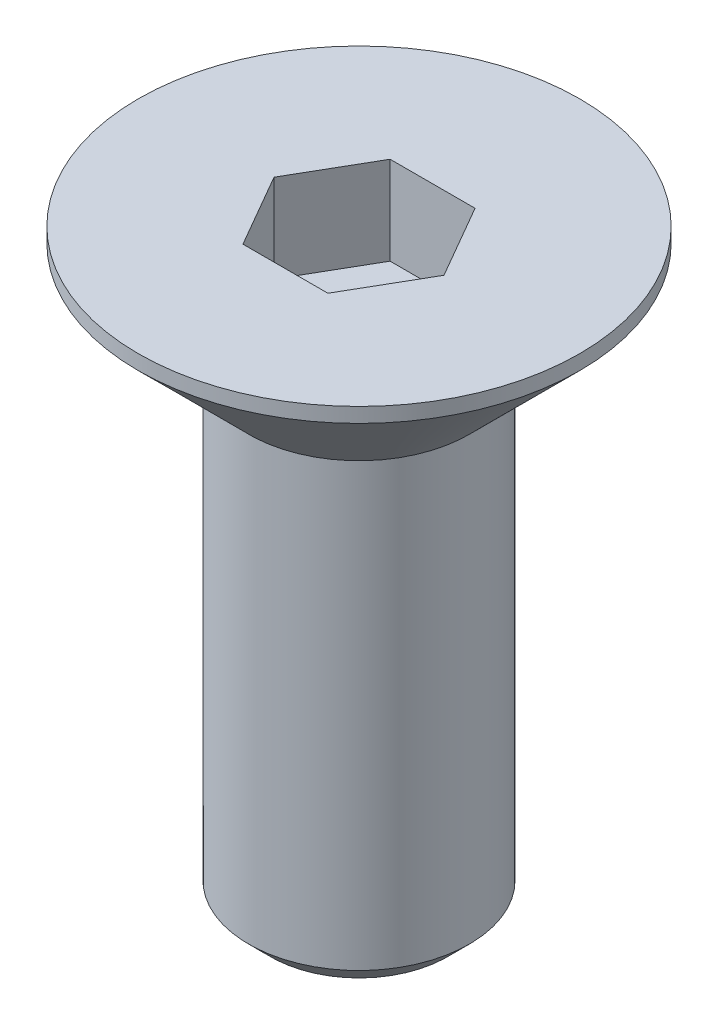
ISO-10303-21;
HEADER;
FILE_DESCRIPTION(('STEP AP214'),'2;1');
FILE_NAME('part.step','',(''),(''),'','','');
FILE_SCHEMA(('AUTOMOTIVE_DESIGN { 1 0 10303 214 1 1 1 1 }'));
ENDSEC;
DATA;
#1=APPLICATION_CONTEXT('core data for automotive mechanical design processes');
#2=APPLICATION_PROTOCOL_DEFINITION('international standard','automotive_design',2000,#1);
#3=PRODUCT_CONTEXT('',#1,'mechanical');
#4=PRODUCT('Part','Part','',(#3));
#5=PRODUCT_RELATED_PRODUCT_CATEGORY('part','',(#4));
#6=PRODUCT_DEFINITION_FORMATION('','',#4);
#7=PRODUCT_DEFINITION_CONTEXT('part definition',#1,'design');
#8=PRODUCT_DEFINITION('design','',#6,#7);
#9=PRODUCT_DEFINITION_SHAPE('','',#8);
#10=(LENGTH_UNIT() NAMED_UNIT(*) SI_UNIT(.MILLI.,.METRE.));
#11=(NAMED_UNIT(*) PLANE_ANGLE_UNIT() SI_UNIT($,.RADIAN.));
#12=(NAMED_UNIT(*) SI_UNIT($,.STERADIAN.) SOLID_ANGLE_UNIT());
#13=UNCERTAINTY_MEASURE_WITH_UNIT(LENGTH_MEASURE(1.E-05),#10,'distance_accuracy_value','');
#14=(GEOMETRIC_REPRESENTATION_CONTEXT(3) GLOBAL_UNCERTAINTY_ASSIGNED_CONTEXT((#13)) GLOBAL_UNIT_ASSIGNED_CONTEXT((#10,
#11,#12)) REPRESENTATION_CONTEXT('',''));
#15=CARTESIAN_POINT('',(0.,0.,0.));
#16=DIRECTION('',(0.,0.,1.));
#17=DIRECTION('',(1.,0.,0.));
#18=AXIS2_PLACEMENT_3D('',#15,#16,#17);
#19=CARTESIAN_POINT('',(0.,0.,0.));
#20=DIRECTION('',(0.,-1.,0.));
#21=DIRECTION('',(0.,0.,-1.00000000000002));
#22=AXIS2_PLACEMENT_3D('',#19,#20,#21);
#23=PLANE('',#22);
#24=CARTESIAN_POINT('',(0.,0.,0.));
#25=DIRECTION('',(0.,-1.,0.));
#26=DIRECTION('',(0.,0.,-1.00000000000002));
#27=AXIS2_PLACEMENT_3D('',#24,#25,#26);
#28=CIRCLE('',#27,1.2);
#29=CARTESIAN_POINT('',(0.,0.,-1.19999999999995));
#30=VERTEX_POINT('',#29);
#31=EDGE_CURVE('E49',#30,#30,#28,.T.);
#32=ORIENTED_EDGE('',*,*,#31,.T.);
#33=EDGE_LOOP('',(#32));
#34=FACE_BOUND('',#33,.T.);
#35=ADVANCED_FACE('F42',(#34),#23,.T.);
#36=CARTESIAN_POINT('',(0.,0.,0.));
#37=DIRECTION('',(0.,-1.,0.));
#38=DIRECTION('',(0.,0.,-1.00000000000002));
#39=AXIS2_PLACEMENT_3D('',#36,#37,#38);
#40=CYLINDRICAL_SURFACE('',#39,1.5);
#41=CARTESIAN_POINT('',(0.,0.300000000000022,0.));
#42=DIRECTION('',(0.,-1.,0.));
#43=DIRECTION('',(0.,0.,-1.00000000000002));
#44=AXIS2_PLACEMENT_3D('',#41,#42,#43);
#45=CIRCLE('',#44,1.5);
#46=CARTESIAN_POINT('',(0.,0.300000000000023,-1.50000000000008));
#47=VERTEX_POINT('',#46);
#48=EDGE_CURVE('E11',#47,#47,#45,.F.);
#49=ORIENTED_EDGE('',*,*,#48,.T.);
#50=EDGE_LOOP('',(#49));
#51=FACE_BOUND('',#50,.T.);
#52=CARTESIAN_POINT('',(1.52655665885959E-13,6.29999999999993,0.));
#53=DIRECTION('',(0.,-1.,0.));
#54=DIRECTION('',(0.,0.,-1.00000000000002));
#55=AXIS2_PLACEMENT_3D('',#52,#53,#54);
#56=CIRCLE('',#55,1.5);
#57=CARTESIAN_POINT('',(1.52072798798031E-13,6.29999999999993,-1.49999999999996));
#58=VERTEX_POINT('',#57);
#59=EDGE_CURVE('E156',#58,#58,#56,.T.);
#60=ORIENTED_EDGE('',*,*,#59,.T.);
#61=EDGE_LOOP('',(#60));
#62=FACE_BOUND('',#61,.T.);
#63=ADVANCED_FACE('F177',(#51,#62),#40,.T.);
#64=CARTESIAN_POINT('',(1.52655665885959E-13,6.29999999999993,0.));
#65=DIRECTION('',(0.,1.,0.));
#66=DIRECTION('',(0.,0.,1.00000000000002));
#67=AXIS2_PLACEMENT_3D('',#64,#65,#66);
#68=CONICAL_SURFACE('',#67,1.5,0.78539816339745);
#69=CARTESIAN_POINT('',(0.,7.79999999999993,0.));
#70=DIRECTION('',(0.,-1.,0.));
#71=DIRECTION('',(0.,0.,-1.00000000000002));
#72=AXIS2_PLACEMENT_3D('',#69,#70,#71);
#73=CIRCLE('',#72,3.);
#74=CARTESIAN_POINT('',(0.,7.79999999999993,-3.));
#75=VERTEX_POINT('',#74);
#76=EDGE_CURVE('E153',#75,#75,#73,.T.);
#77=ORIENTED_EDGE('',*,*,#76,.T.);
#78=EDGE_LOOP('',(#77));
#79=FACE_BOUND('',#78,.T.);
#80=ORIENTED_EDGE('',*,*,#59,.F.);
#81=EDGE_LOOP('',(#80));
#82=FACE_BOUND('',#81,.T.);
#83=ADVANCED_FACE('F181',(#79,#82),#68,.T.);
#84=CARTESIAN_POINT('',(0.,0.,0.));
#85=DIRECTION('',(0.,-1.,0.));
#86=DIRECTION('',(0.,0.,-1.00000000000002));
#87=AXIS2_PLACEMENT_3D('',#84,#85,#86);
#88=CYLINDRICAL_SURFACE('',#87,3.);
#89=CARTESIAN_POINT('',(0.,7.99999999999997,1.2490009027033E-13));
#90=DIRECTION('',(0.,-1.,0.));
#91=DIRECTION('',(0.,0.,-1.00000000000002));
#92=AXIS2_PLACEMENT_3D('',#89,#90,#91);
#93=CIRCLE('',#92,3.);
#94=CARTESIAN_POINT('',(0.,7.99999999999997,-2.99999999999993));
#95=VERTEX_POINT('',#94);
#96=EDGE_CURVE('E144',#95,#95,#93,.T.);
#97=ORIENTED_EDGE('',*,*,#96,.T.);
#98=EDGE_LOOP('',(#97));
#99=FACE_BOUND('',#98,.T.);
#100=ORIENTED_EDGE('',*,*,#76,.F.);
#101=EDGE_LOOP('',(#100));
#102=FACE_BOUND('',#101,.T.);
#103=ADVANCED_FACE('F173',(#99,#102),#88,.T.);
#104=CARTESIAN_POINT('',(3.00000000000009,7.99999999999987,2.35922392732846E-13));
#105=DIRECTION('',(0.,1.,0.));
#106=DIRECTION('',(0.,0.,1.00000000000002));
#107=AXIS2_PLACEMENT_3D('',#104,#105,#106);
#108=PLANE('',#107);
#109=DIRECTION('',(1.00000000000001,0.,0.));
#110=VECTOR('',#109,1.);
#111=CARTESIAN_POINT('',(-0.577350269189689,8.00000000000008,0.999999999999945));
#112=LINE('',#111,#110);
#113=CARTESIAN_POINT('',(-0.577350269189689,8.00000000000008,0.999999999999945));
#114=VERTEX_POINT('',#113);
#115=CARTESIAN_POINT('',(0.577350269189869,8.00000000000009,1.0000000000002));
#116=VERTEX_POINT('',#115);
#117=EDGE_CURVE('E56',#114,#116,#112,.T.);
#118=ORIENTED_EDGE('',*,*,#117,.F.);
#119=DIRECTION('',(0.500000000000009,0.,0.866025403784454));
#120=VECTOR('',#119,1.);
#121=CARTESIAN_POINT('',(-1.15470053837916,7.99999999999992,0.));
#122=LINE('',#121,#120);
#123=CARTESIAN_POINT('',(-1.15470053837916,7.99999999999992,0.));
#124=VERTEX_POINT('',#123);
#125=EDGE_CURVE('E126',#124,#114,#122,.T.);
#126=ORIENTED_EDGE('',*,*,#125,.F.);
#127=DIRECTION('',(-0.500000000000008,0.,0.866025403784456));
#128=VECTOR('',#127,1.);
#129=CARTESIAN_POINT('',(-0.577350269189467,7.99999999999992,-0.999999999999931));
#130=LINE('',#129,#128);
#131=CARTESIAN_POINT('',(-0.577350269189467,7.99999999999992,-0.999999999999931));
#132=VERTEX_POINT('',#131);
#133=EDGE_CURVE('E120',#132,#124,#130,.T.);
#134=ORIENTED_EDGE('',*,*,#133,.F.);
#135=DIRECTION('',(-1.00000000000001,0.,0.));
#136=VECTOR('',#135,1.);
#137=CARTESIAN_POINT('',(0.577350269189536,8.00000000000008,-0.999999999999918));
#138=LINE('',#137,#136);
#139=CARTESIAN_POINT('',(0.577350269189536,8.00000000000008,-0.999999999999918));
#140=VERTEX_POINT('',#139);
#141=EDGE_CURVE('E118',#140,#132,#138,.T.);
#142=ORIENTED_EDGE('',*,*,#141,.F.);
#143=DIRECTION('',(-0.500000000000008,0.,-0.866025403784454));
#144=VECTOR('',#143,1.);
#145=CARTESIAN_POINT('',(1.15470053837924,7.99999999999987,2.4980018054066E-13));
#146=LINE('',#145,#144);
#147=CARTESIAN_POINT('',(1.15470053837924,7.99999999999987,2.4980018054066E-13));
#148=VERTEX_POINT('',#147);
#149=EDGE_CURVE('E99',#148,#140,#146,.T.);
#150=ORIENTED_EDGE('',*,*,#149,.F.);
#151=DIRECTION('',(0.500000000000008,0.,-0.866025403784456));
#152=VECTOR('',#151,1.);
#153=CARTESIAN_POINT('',(0.577350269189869,8.00000000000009,1.0000000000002));
#154=LINE('',#153,#152);
#155=EDGE_CURVE('E110',#116,#148,#154,.T.);
#156=ORIENTED_EDGE('',*,*,#155,.F.);
#157=EDGE_LOOP('',(#118,#126,#134,#142,#150,#156));
#158=FACE_BOUND('',#157,.T.);
#159=ORIENTED_EDGE('',*,*,#96,.F.);
#160=EDGE_LOOP('',(#159));
#161=FACE_BOUND('',#160,.T.);
#162=ADVANCED_FACE('F114',(#158,#161),#108,.T.);
#163=CARTESIAN_POINT('',(0.,0.,0.));
#164=DIRECTION('',(0.,1.,0.));
#165=DIRECTION('',(0.,0.,1.00000000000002));
#166=AXIS2_PLACEMENT_3D('',#163,#164,#165);
#167=CONICAL_SURFACE('',#166,1.2,0.785398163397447);
#168=ORIENTED_EDGE('',*,*,#48,.F.);
#169=EDGE_LOOP('',(#168));
#170=FACE_BOUND('',#169,.T.);
#171=ORIENTED_EDGE('',*,*,#31,.F.);
#172=EDGE_LOOP('',(#171));
#173=FACE_BOUND('',#172,.T.);
#174=ADVANCED_FACE('F162',(#170,#173),#167,.T.);
#175=CARTESIAN_POINT('',(-0.577350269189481,6.80000000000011,1.));
#176=DIRECTION('',(0.,0.,1.00000000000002));
#177=DIRECTION('',(1.00000000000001,0.,0.));
#178=AXIS2_PLACEMENT_3D('',#175,#176,#177);
#179=PLANE('',#178);
#180=ORIENTED_EDGE('',*,*,#117,.T.);
#181=DIRECTION('',(0.,1.,0.));
#182=VECTOR('',#181,1.);
#183=CARTESIAN_POINT('',(0.57735026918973,6.8,1.00000000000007));
#184=LINE('',#183,#182);
#185=CARTESIAN_POINT('',(0.57735026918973,6.8,1.00000000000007));
#186=VERTEX_POINT('',#185);
#187=EDGE_CURVE('E107',#186,#116,#184,.T.);
#188=ORIENTED_EDGE('',*,*,#187,.F.);
#189=DIRECTION('',(1.00000000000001,0.,0.));
#190=VECTOR('',#189,1.);
#191=CARTESIAN_POINT('',(-0.577350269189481,6.80000000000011,1.));
#192=LINE('',#191,#190);
#193=CARTESIAN_POINT('',(-0.577350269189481,6.80000000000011,1.));
#194=VERTEX_POINT('',#193);
#195=EDGE_CURVE('E128',#194,#186,#192,.T.);
#196=ORIENTED_EDGE('',*,*,#195,.F.);
#197=DIRECTION('',(0.,1.,0.));
#198=VECTOR('',#197,1.);
#199=CARTESIAN_POINT('',(-0.577350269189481,6.80000000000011,1.));
#200=LINE('',#199,#198);
#201=EDGE_CURVE('E63',#194,#114,#200,.T.);
#202=ORIENTED_EDGE('',*,*,#201,.T.);
#203=EDGE_LOOP('',(#180,#188,#196,#202));
#204=FACE_BOUND('',#203,.T.);
#205=ADVANCED_FACE('F164',(#204),#179,.F.);
#206=CARTESIAN_POINT('',(-1.15470053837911,6.79999999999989,2.35922392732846E-13));
#207=DIRECTION('',(-0.866025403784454,0.,0.50000000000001));
#208=DIRECTION('',(0.500000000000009,0.,0.866025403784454));
#209=AXIS2_PLACEMENT_3D('',#206,#207,#208);
#210=PLANE('',#209);
#211=ORIENTED_EDGE('',*,*,#125,.T.);
#212=ORIENTED_EDGE('',*,*,#201,.F.);
#213=DIRECTION('',(0.500000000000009,0.,0.866025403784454));
#214=VECTOR('',#213,1.);
#215=CARTESIAN_POINT('',(-1.15470053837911,6.79999999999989,2.35922392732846E-13));
#216=LINE('',#215,#214);
#217=CARTESIAN_POINT('',(-1.15470053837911,6.79999999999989,2.35922392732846E-13));
#218=VERTEX_POINT('',#217);
#219=EDGE_CURVE('E140',#218,#194,#216,.T.);
#220=ORIENTED_EDGE('',*,*,#219,.F.);
#221=DIRECTION('',(0.,1.,0.));
#222=VECTOR('',#221,1.);
#223=CARTESIAN_POINT('',(-1.15470053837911,6.79999999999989,2.35922392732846E-13));
#224=LINE('',#223,#222);
#225=EDGE_CURVE('E145',#218,#124,#224,.T.);
#226=ORIENTED_EDGE('',*,*,#225,.T.);
#227=EDGE_LOOP('',(#211,#212,#220,#226));
#228=FACE_BOUND('',#227,.T.);
#229=ADVANCED_FACE('F171',(#228),#210,.F.);
#230=CARTESIAN_POINT('',(-0.577350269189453,6.79999999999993,-0.99999999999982));
#231=DIRECTION('',(-0.866025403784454,0.,-0.500000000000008));
#232=DIRECTION('',(-0.500000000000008,0.,0.866025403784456));
#233=AXIS2_PLACEMENT_3D('',#230,#231,#232);
#234=PLANE('',#233);
#235=ORIENTED_EDGE('',*,*,#133,.T.);
#236=ORIENTED_EDGE('',*,*,#225,.F.);
#237=DIRECTION('',(-0.500000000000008,0.,0.866025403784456));
#238=VECTOR('',#237,1.);
#239=CARTESIAN_POINT('',(-0.577350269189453,6.79999999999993,-0.99999999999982));
#240=LINE('',#239,#238);
#241=CARTESIAN_POINT('',(-0.577350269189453,6.79999999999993,-0.99999999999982));
#242=VERTEX_POINT('',#241);
#243=EDGE_CURVE('E137',#242,#218,#240,.T.);
#244=ORIENTED_EDGE('',*,*,#243,.F.);
#245=DIRECTION('',(0.,1.,0.));
#246=VECTOR('',#245,1.);
#247=CARTESIAN_POINT('',(-0.577350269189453,6.79999999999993,-0.99999999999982));
#248=LINE('',#247,#246);
#249=EDGE_CURVE('E147',#242,#132,#248,.T.);
#250=ORIENTED_EDGE('',*,*,#249,.T.);
#251=EDGE_LOOP('',(#235,#236,#244,#250));
#252=FACE_BOUND('',#251,.T.);
#253=ADVANCED_FACE('F224',(#252),#234,.F.);
#254=CARTESIAN_POINT('',(0.577350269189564,6.79999999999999,-0.999999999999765));
#255=DIRECTION('',(0.,0.,-1.00000000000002));
#256=DIRECTION('',(-1.00000000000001,0.,0.));
#257=AXIS2_PLACEMENT_3D('',#254,#255,#256);
#258=PLANE('',#257);
#259=ORIENTED_EDGE('',*,*,#141,.T.);
#260=ORIENTED_EDGE('',*,*,#249,.F.);
#261=DIRECTION('',(-1.00000000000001,0.,0.));
#262=VECTOR('',#261,1.);
#263=CARTESIAN_POINT('',(0.577350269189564,6.79999999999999,-0.999999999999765));
#264=LINE('',#263,#262);
#265=CARTESIAN_POINT('',(0.577350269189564,6.79999999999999,-0.999999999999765));
#266=VERTEX_POINT('',#265);
#267=EDGE_CURVE('E134',#266,#242,#264,.T.);
#268=ORIENTED_EDGE('',*,*,#267,.F.);
#269=DIRECTION('',(0.,1.,0.));
#270=VECTOR('',#269,1.);
#271=CARTESIAN_POINT('',(0.577350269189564,6.79999999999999,-0.999999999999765));
#272=LINE('',#271,#270);
#273=EDGE_CURVE('E106',#266,#140,#272,.T.);
#274=ORIENTED_EDGE('',*,*,#273,.T.);
#275=EDGE_LOOP('',(#259,#260,#268,#274));
#276=FACE_BOUND('',#275,.T.);
#277=ADVANCED_FACE('F233',(#276),#258,.F.);
#278=CARTESIAN_POINT('',(1.1547005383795,6.79999999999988,0.));
#279=DIRECTION('',(0.866025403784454,0.,-0.50000000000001));
#280=DIRECTION('',(-0.500000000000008,0.,-0.866025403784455));
#281=AXIS2_PLACEMENT_3D('',#278,#279,#280);
#282=PLANE('',#281);
#283=ORIENTED_EDGE('',*,*,#149,.T.);
#284=ORIENTED_EDGE('',*,*,#273,.F.);
#285=DIRECTION('',(-0.500000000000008,0.,-0.866025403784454));
#286=VECTOR('',#285,1.);
#287=CARTESIAN_POINT('',(1.1547005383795,6.79999999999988,0.));
#288=LINE('',#287,#286);
#289=CARTESIAN_POINT('',(1.1547005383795,6.79999999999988,0.));
#290=VERTEX_POINT('',#289);
#291=EDGE_CURVE('E102',#290,#266,#288,.T.);
#292=ORIENTED_EDGE('',*,*,#291,.F.);
#293=DIRECTION('',(0.,1.,0.));
#294=VECTOR('',#293,1.);
#295=CARTESIAN_POINT('',(1.1547005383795,6.79999999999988,0.));
#296=LINE('',#295,#294);
#297=EDGE_CURVE('E95',#290,#148,#296,.T.);
#298=ORIENTED_EDGE('',*,*,#297,.T.);
#299=EDGE_LOOP('',(#283,#284,#292,#298));
#300=FACE_BOUND('',#299,.T.);
#301=ADVANCED_FACE('F97',(#300),#282,.F.);
#302=CARTESIAN_POINT('',(0.57735026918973,6.8,1.00000000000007));
#303=DIRECTION('',(0.866025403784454,0.,0.500000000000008));
#304=DIRECTION('',(0.500000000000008,0.,-0.866025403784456));
#305=AXIS2_PLACEMENT_3D('',#302,#303,#304);
#306=PLANE('',#305);
#307=ORIENTED_EDGE('',*,*,#155,.T.);
#308=ORIENTED_EDGE('',*,*,#297,.F.);
#309=DIRECTION('',(0.500000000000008,0.,-0.866025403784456));
#310=VECTOR('',#309,1.);
#311=CARTESIAN_POINT('',(0.57735026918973,6.8,1.00000000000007));
#312=LINE('',#311,#310);
#313=EDGE_CURVE('E131',#186,#290,#312,.T.);
#314=ORIENTED_EDGE('',*,*,#313,.F.);
#315=ORIENTED_EDGE('',*,*,#187,.T.);
#316=EDGE_LOOP('',(#307,#308,#314,#315));
#317=FACE_BOUND('',#316,.T.);
#318=ADVANCED_FACE('F111',(#317),#306,.F.);
#319=CARTESIAN_POINT('',(1.73205080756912,6.79999999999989,1.00000000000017));
#320=DIRECTION('',(0.,1.,0.));
#321=DIRECTION('',(0.,0.,1.00000000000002));
#322=AXIS2_PLACEMENT_3D('',#319,#320,#321);
#323=PLANE('',#322);
#324=ORIENTED_EDGE('',*,*,#195,.T.);
#325=ORIENTED_EDGE('',*,*,#313,.T.);
#326=ORIENTED_EDGE('',*,*,#291,.T.);
#327=ORIENTED_EDGE('',*,*,#267,.T.);
#328=ORIENTED_EDGE('',*,*,#243,.T.);
#329=ORIENTED_EDGE('',*,*,#219,.T.);
#330=EDGE_LOOP('',(#324,#325,#326,#327,#328,#329));
#331=FACE_BOUND('',#330,.T.);
#332=ADVANCED_FACE('F260',(#331),#323,.T.);
#333=CLOSED_SHELL('',(#35,#63,#83,#103,#162,#174,#205,#229,#253,#277,#301,#318,#332));
#334=MANIFOLD_SOLID_BREP('B2',#333);
#335=ADVANCED_BREP_SHAPE_REPRESENTATION('',(#18,#334),#14);
#336=SHAPE_DEFINITION_REPRESENTATION(#9,#335);
ENDSEC;
END-ISO-10303-21;
